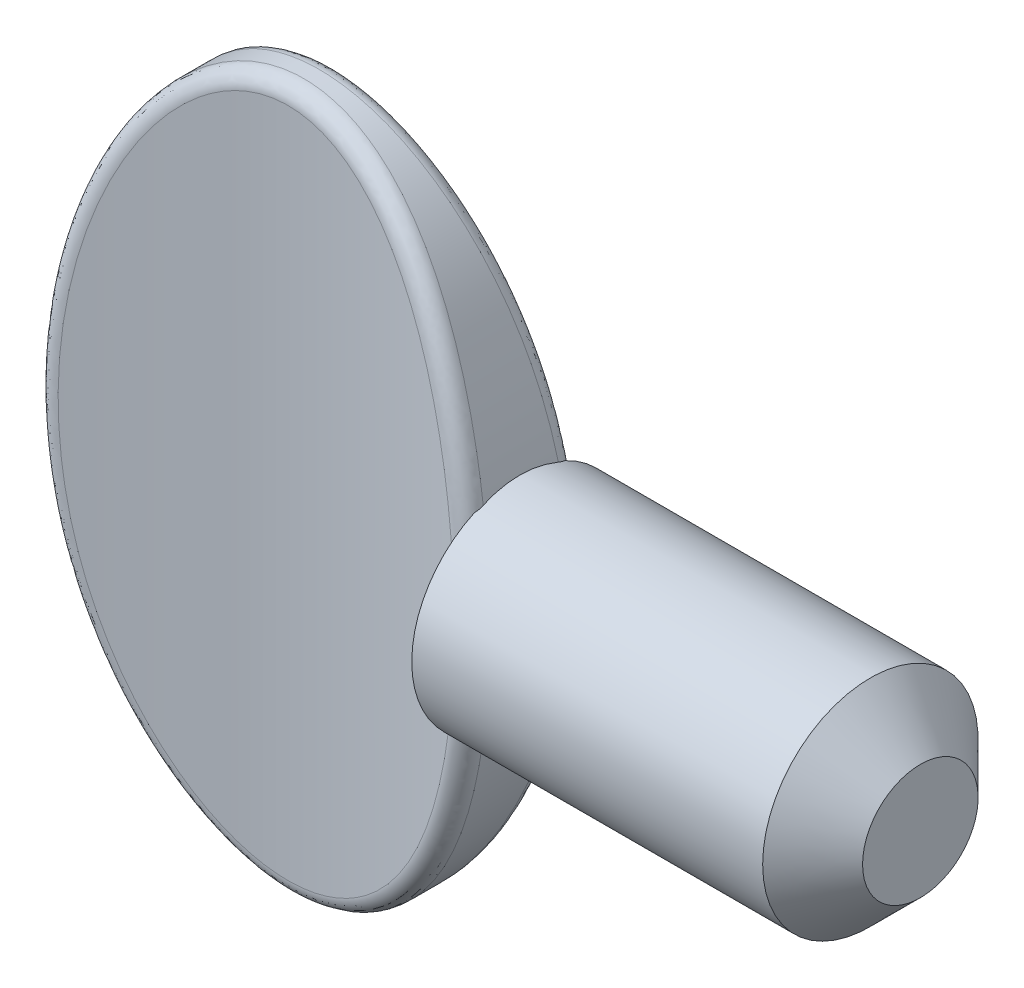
from build123d import *

# Parameters (mm, degrees)
SKETCH1_RX              = 5.715
SKETCH1_RY              = 3.556
EXTRUDE1_DEPTH          = 1.016
CUT_EXTRUDE1_DEPTH      = 7.8072473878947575
CUT_EXTRUDE1_DEPTH_BACK = 7.8072473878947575
SKETCH2_OUTSIDE_W       = 11.834000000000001
SKETCH2_OUTSIDE_H       = 6.754
FILLET3_R               = 0.254


with BuildPart() as part:
    # Sketch1 → Extrude1 (new, symmetric)
    with BuildSketch(Plane.XY):
        with Locations(Location((0, 0), (0, 0, -90))):
            Ellipse(SKETCH1_RX, SKETCH1_RY)
    extrude(amount=EXTRUDE1_DEPTH, both=True)

    # Sketch2 outside → Cut-Extrude1 (cut, two sides: drawn at the far end of the back side and taken through both)
    with BuildSketch(Plane(origin=(0, 0, 0), x_dir=(1, 0, 0), z_dir=(0, 1, 0)).offset(-CUT_EXTRUDE1_DEPTH_BACK)):
        Rectangle(SKETCH2_OUTSIDE_W, SKETCH2_OUTSIDE_H)
        with BuildLine():
            Line((-3.556, 1.016), (-3.556, -1.016))
            ThreePointArc((-3.556, -1.016), (6.3e-16, -0.3810000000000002), (3.556, -1.016))
            Line((3.556, -1.016), (3.556, 1.016))
            ThreePointArc((3.556, 1.016), (6.3e-16, 0.3810000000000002), (-3.556, 1.016))
        make_face(mode=Mode.SUBTRACT)
    extrude(amount=CUT_EXTRUDE1_DEPTH + CUT_EXTRUDE1_DEPTH_BACK, mode=Mode.SUBTRACT)

    # Fillet3
    fillet3_edges = [part.edges().sort_by_distance(p)[0] for p in [
        (-2.772297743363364, -3.579097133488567, 0.7620899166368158),
        (6.761380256e-08, 5.714999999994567, -0.38099999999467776),
    ]]
    fillet(fillet3_edges, radius=FILLET3_R)

    # Sketch3 → Revolve1 (revolve)
    with BuildSketch(Plane(origin=(0, 0, 0), x_dir=(1, 0, 0), z_dir=(0, 1, 0)), mode=Mode.PRIVATE) as revolve1_sk:
        with BuildLine():
            Line((9.906, 0), (9.906, 0.9398))
            Line((9.906, 0.9398), (9.09319999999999, 1.7526))
            Line((9.09319999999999, 1.7526), (4.741333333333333, 1.7526))
            Line((4.741333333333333, 1.7526), (3.3846611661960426, 1.7526000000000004))
            ThreePointArc((3.3846611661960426, 1.7526000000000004), (3.1592934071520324, 1.093146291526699), (2.577464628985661, 0.7095513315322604))
            Line((2.577464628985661, 0.7095513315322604), (2.577464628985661, 1e-17))
            Line((2.577464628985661, 1e-17), (9.906, 0))
        make_face()
    revolve(revolve1_sk.sketch.rotate(Axis((0, 0, 0), (1, 0, 0)), 180), axis=Axis((0, 0, 0), (1, 0, 0)))


solid = part.part
